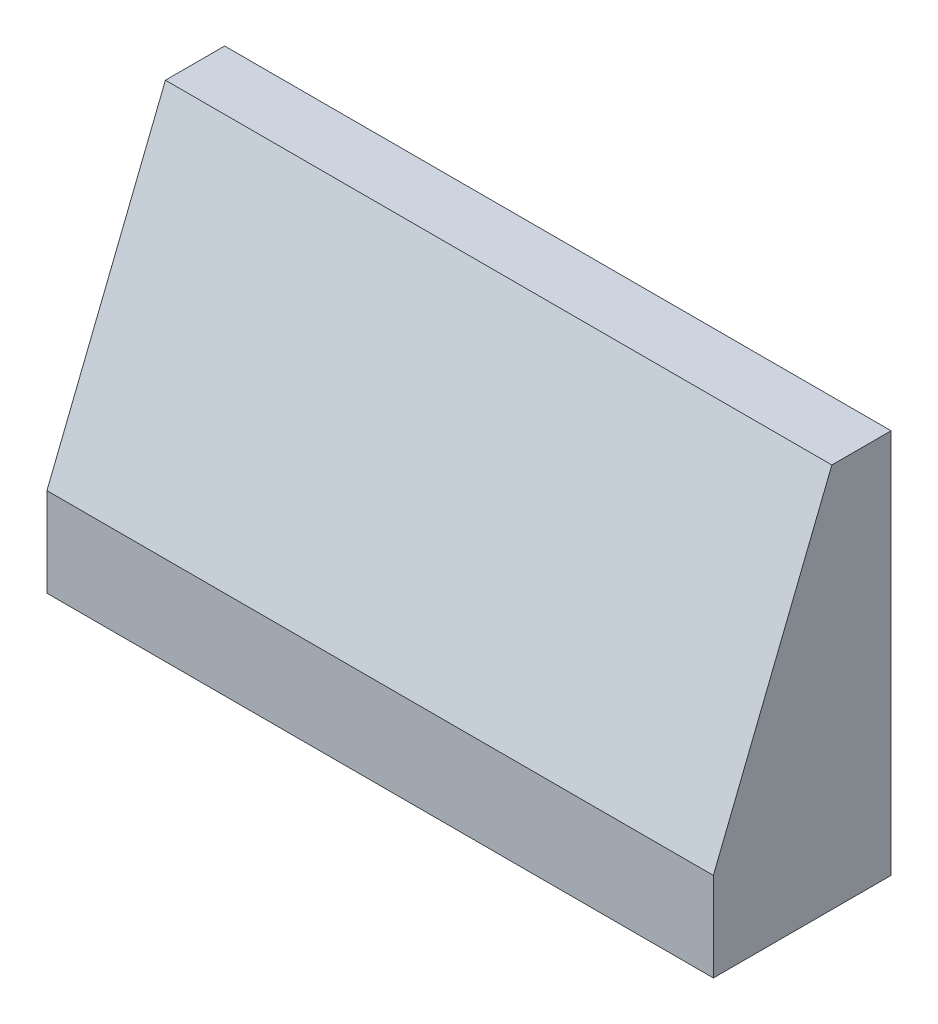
from build123d import *

# Parameters (mm, degrees)
BOSS_EXTRUDE1_DEPTH = 45
SKETCH3_R           = 4
CUT_EXTRUDE1_DEPTH  = 5


with BuildPart() as part:
    # Sketch2 → Boss-Extrude1 (new body)
    with BuildSketch(Plane(origin=(0, 0, 0), x_dir=(0, 0, -1), z_dir=(1, 0, 0))):
        Polygon((12, 6), (12, 26), (8, 26), (0, 6), (0, 0), (12, 0), align=None)
    extrude(amount=-BOSS_EXTRUDE1_DEPTH)

    # Sketch3 → Cut-Extrude1 (cut)
    with BuildSketch(Plane.XZ):
        with Locations(Location((-33.75, -6, 0), (0, 0, 270))):
            Circle(SKETCH3_R)
        with Locations(Location((-11.25, -6, 0), (0, 0, 270))):
            Circle(SKETCH3_R)
    extrude(amount=-CUT_EXTRUDE1_DEPTH, mode=Mode.SUBTRACT)


solid = part.part
